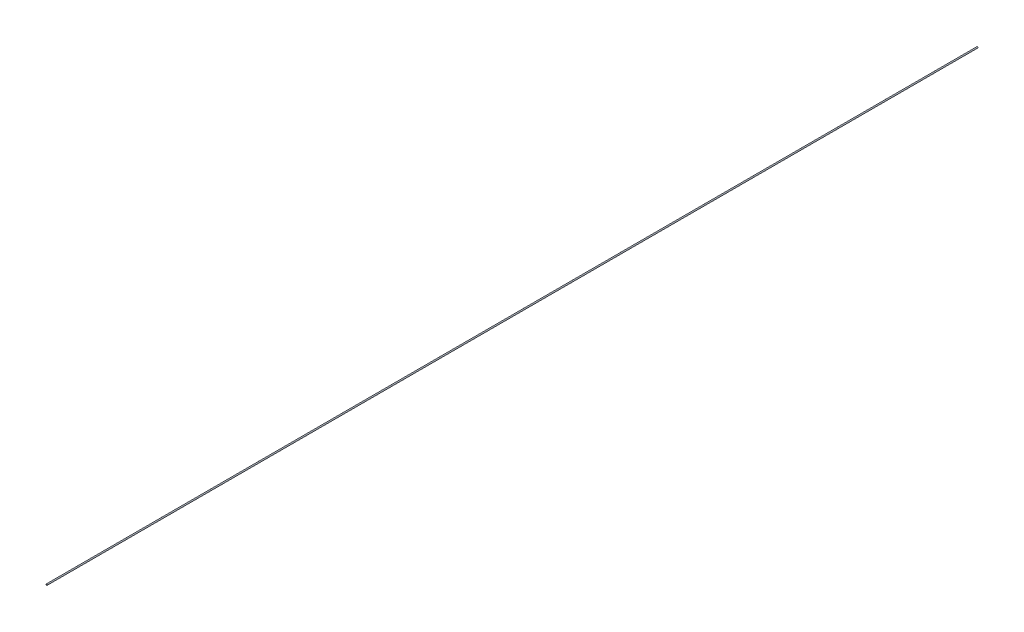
ISO-10303-21;
HEADER;
FILE_DESCRIPTION(('STEP AP214'),'2;1');
FILE_NAME('part.step','',(''),(''),'','','');
FILE_SCHEMA(('AUTOMOTIVE_DESIGN { 1 0 10303 214 1 1 1 1 }'));
ENDSEC;
DATA;
#1=APPLICATION_CONTEXT('core data for automotive mechanical design processes');
#2=APPLICATION_PROTOCOL_DEFINITION('international standard','automotive_design',2000,#1);
#3=PRODUCT_CONTEXT('',#1,'mechanical');
#4=PRODUCT('Part','Part','',(#3));
#5=PRODUCT_RELATED_PRODUCT_CATEGORY('part','',(#4));
#6=PRODUCT_DEFINITION_FORMATION('','',#4);
#7=PRODUCT_DEFINITION_CONTEXT('part definition',#1,'design');
#8=PRODUCT_DEFINITION('design','',#6,#7);
#9=PRODUCT_DEFINITION_SHAPE('','',#8);
#10=(LENGTH_UNIT() NAMED_UNIT(*) SI_UNIT(.MILLI.,.METRE.));
#11=(NAMED_UNIT(*) PLANE_ANGLE_UNIT() SI_UNIT($,.RADIAN.));
#12=(NAMED_UNIT(*) SI_UNIT($,.STERADIAN.) SOLID_ANGLE_UNIT());
#13=UNCERTAINTY_MEASURE_WITH_UNIT(LENGTH_MEASURE(1.E-05),#10,'distance_accuracy_value','');
#14=(GEOMETRIC_REPRESENTATION_CONTEXT(3) GLOBAL_UNCERTAINTY_ASSIGNED_CONTEXT((#13)) GLOBAL_UNIT_ASSIGNED_CONTEXT((#10,
#11,#12)) REPRESENTATION_CONTEXT('',''));
#15=CARTESIAN_POINT('',(0.,0.,0.));
#16=DIRECTION('',(0.,0.,1.));
#17=DIRECTION('',(1.,0.,0.));
#18=AXIS2_PLACEMENT_3D('',#15,#16,#17);
#19=CARTESIAN_POINT('',(0.,0.,-1725.75735931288));
#20=DIRECTION('',(0.,0.,-1.));
#21=DIRECTION('',(-1.,0.,0.));
#22=AXIS2_PLACEMENT_3D('',#19,#20,#21);
#23=CYLINDRICAL_SURFACE('',#22,1.49999999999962);
#24=CARTESIAN_POINT('',(0.,0.,-4089.99999999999));
#25=DIRECTION('',(0.,0.,1.));
#26=DIRECTION('',(1.,0.,0.));
#27=AXIS2_PLACEMENT_3D('',#24,#25,#26);
#28=CIRCLE('',#27,1.49999999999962);
#29=CARTESIAN_POINT('',(1.49999999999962,0.,-4089.99999999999));
#30=VERTEX_POINT('',#29);
#31=EDGE_CURVE('E38',#30,#30,#28,.T.);
#32=ORIENTED_EDGE('',*,*,#31,.T.);
#33=EDGE_LOOP('',(#32));
#34=FACE_BOUND('',#33,.T.);
#35=CARTESIAN_POINT('',(0.,0.,-1729.99999999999));
#36=DIRECTION('',(0.,0.,1.));
#37=DIRECTION('',(1.,0.,0.));
#38=AXIS2_PLACEMENT_3D('',#35,#36,#37);
#39=CIRCLE('',#38,1.49999999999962);
#40=CARTESIAN_POINT('',(1.49999999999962,0.,-1729.99999999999));
#41=VERTEX_POINT('',#40);
#42=EDGE_CURVE('E10',#41,#41,#39,.T.);
#43=ORIENTED_EDGE('',*,*,#42,.F.);
#44=EDGE_LOOP('',(#43));
#45=FACE_BOUND('',#44,.T.);
#46=ADVANCED_FACE('F31',(#34,#45),#23,.T.);
#47=CARTESIAN_POINT('',(0.,0.,-4089.99999999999));
#48=DIRECTION('',(0.,0.,1.));
#49=DIRECTION('',(1.,0.,0.));
#50=AXIS2_PLACEMENT_3D('',#47,#48,#49);
#51=PLANE('',#50);
#52=ORIENTED_EDGE('',*,*,#31,.F.);
#53=EDGE_LOOP('',(#52));
#54=FACE_BOUND('',#53,.T.);
#55=ADVANCED_FACE('F46',(#54),#51,.F.);
#56=CARTESIAN_POINT('',(10.2707709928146,36.6103795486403,-1729.99999999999));
#57=DIRECTION('',(0.,0.,1.));
#58=DIRECTION('',(0.999731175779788,-0.0231856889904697,0.));
#59=AXIS2_PLACEMENT_3D('',#56,#57,#58);
#60=PLANE('',#59);
#61=ORIENTED_EDGE('',*,*,#42,.T.);
#62=EDGE_LOOP('',(#61));
#63=FACE_BOUND('',#62,.T.);
#64=ADVANCED_FACE('F33',(#63),#60,.T.);
#65=CLOSED_SHELL('',(#46,#55,#64));
#66=MANIFOLD_SOLID_BREP('B2',#65);
#67=ADVANCED_BREP_SHAPE_REPRESENTATION('',(#18,#66),#14);
#68=SHAPE_DEFINITION_REPRESENTATION(#9,#67);
ENDSEC;
END-ISO-10303-21;
